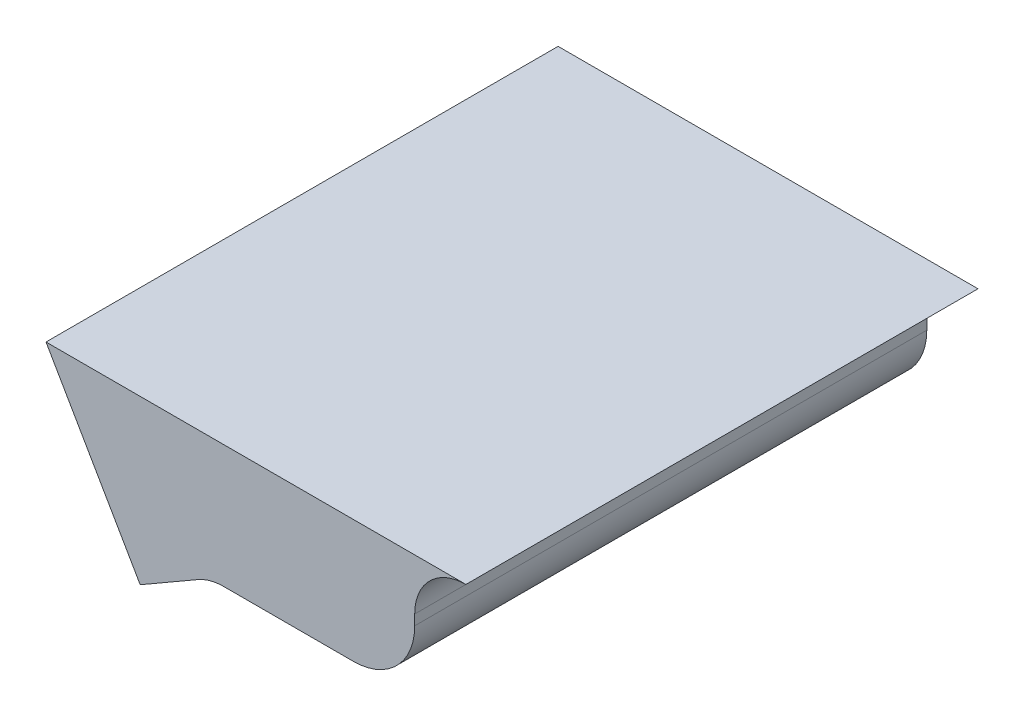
from build123d import *

# Parameters (mm, degrees)
SKETCH1_W          = 50
SKETCH1_H          = 5
BASE_EXTRUDE_DEPTH = 25
LANCE_TOOL_DEPTH   = 12.5
INSIDE_FILLET_R    = 2.5
ROUND_2_R          = 3
SKETCH3_W          = 50
SKETCH3_H          = 5
CLEANUP_CUT_DEPTH  = 57.46615725


with BuildPart() as part:
    # Sketch1 → Base-Extrude (new, symmetric)
    with BuildSketch(Plane.XY):
        with Locations((0, 2.5)):
            Rectangle(SKETCH1_W, SKETCH1_H)
    extrude(amount=BASE_EXTRUDE_DEPTH, both=True)

    # Lance Tool sketch → Lance Tool (add, symmetric)
    with BuildSketch(Plane.XY):
        Polygon((9, 0), (-9, 0), (-4.401923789, -7.964101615), (-1, -6), (9, -6), align=None)
    extrude(amount=LANCE_TOOL_DEPTH, both=True)

    # Inside Fillet
    inside_fillet_edges = [part.edges().sort_by_distance(p)[0] for p in [
        (9, 0, 0),
        (-1, -6, 0),
    ]]
    fillet(inside_fillet_edges, radius=INSIDE_FILLET_R)

    # Round 2
    round_2_edges = [part.edges().sort_by_distance(p)[0] for p in [
        (9, -6, 0),
    ]]
    fillet(round_2_edges, radius=ROUND_2_R)

    # Sketch3 → Cleanup cut (cut, through all)
    with BuildSketch(Plane(origin=(25, 0, 0), x_dir=(0, 0, -1), z_dir=(1, 0, 0))):
        with Locations((0, 2.5)):
            Rectangle(SKETCH3_W, SKETCH3_H)
    extrude(amount=-CLEANUP_CUT_DEPTH, mode=Mode.SUBTRACT)


solid = part.part
